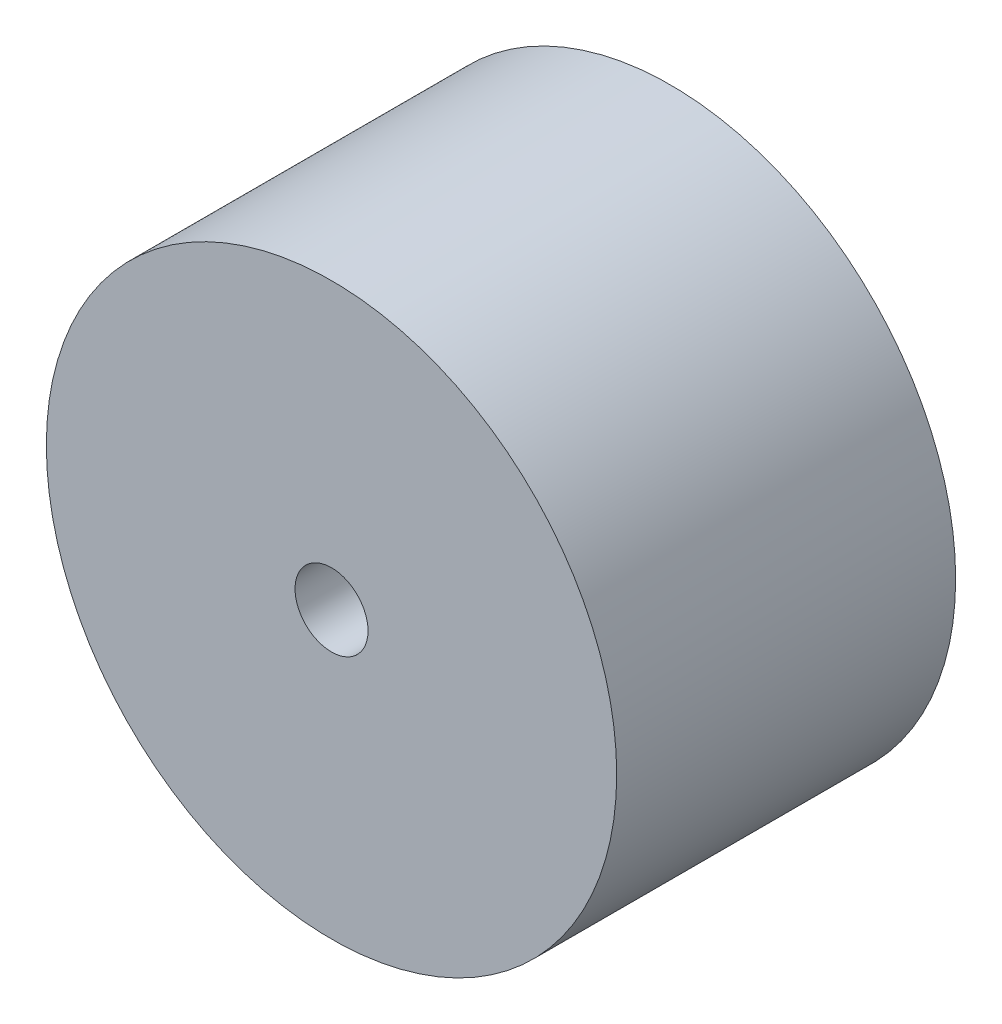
from build123d import *

# Parameters (mm, degrees)
SKETCH1_R           = 25
SKETCH1_R_2         = 3.2
BOSS_EXTRUDE1_DEPTH = 29.7137


with BuildPart() as part:
    # Sketch1 → Boss-Extrude1 (new body)
    with BuildSketch(Plane.XY):
        Circle(SKETCH1_R)
        Circle(SKETCH1_R_2, mode=Mode.SUBTRACT)
    extrude(amount=BOSS_EXTRUDE1_DEPTH)


solid = part.part
